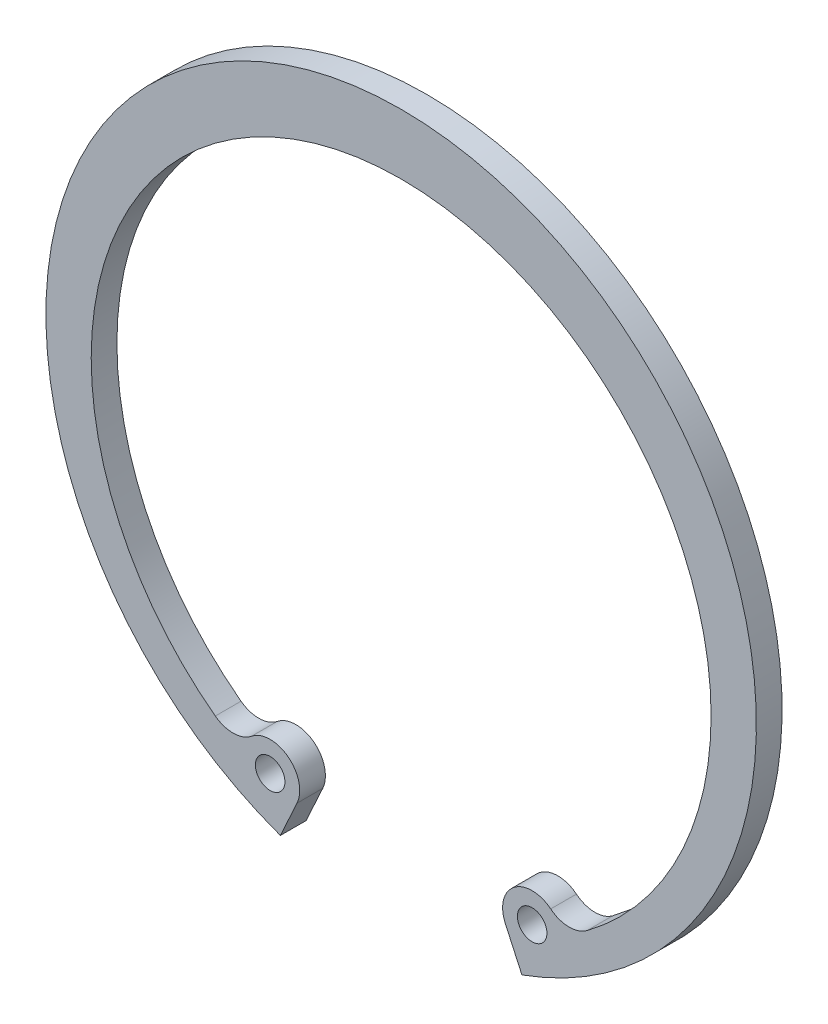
ISO-10303-21;
HEADER;
FILE_DESCRIPTION(('STEP AP214'),'2;1');
FILE_NAME('part.step','',(''),(''),'','','');
FILE_SCHEMA(('AUTOMOTIVE_DESIGN { 1 0 10303 214 1 1 1 1 }'));
ENDSEC;
DATA;
#1=APPLICATION_CONTEXT('core data for automotive mechanical design processes');
#2=APPLICATION_PROTOCOL_DEFINITION('international standard','automotive_design',2000,#1);
#3=PRODUCT_CONTEXT('',#1,'mechanical');
#4=PRODUCT('Part','Part','',(#3));
#5=PRODUCT_RELATED_PRODUCT_CATEGORY('part','',(#4));
#6=PRODUCT_DEFINITION_FORMATION('','',#4);
#7=PRODUCT_DEFINITION_CONTEXT('part definition',#1,'design');
#8=PRODUCT_DEFINITION('design','',#6,#7);
#9=PRODUCT_DEFINITION_SHAPE('','',#8);
#10=(LENGTH_UNIT() NAMED_UNIT(*) SI_UNIT(.MILLI.,.METRE.));
#11=(NAMED_UNIT(*) PLANE_ANGLE_UNIT() SI_UNIT($,.RADIAN.));
#12=(NAMED_UNIT(*) SI_UNIT($,.STERADIAN.) SOLID_ANGLE_UNIT());
#13=UNCERTAINTY_MEASURE_WITH_UNIT(LENGTH_MEASURE(1.E-05),#10,'distance_accuracy_value','');
#14=(GEOMETRIC_REPRESENTATION_CONTEXT(3) GLOBAL_UNCERTAINTY_ASSIGNED_CONTEXT((#13)) GLOBAL_UNIT_ASSIGNED_CONTEXT((#10,
#11,#12)) REPRESENTATION_CONTEXT('',''));
#15=CARTESIAN_POINT('',(0.,0.,0.));
#16=DIRECTION('',(0.,0.,1.));
#17=DIRECTION('',(1.,0.,0.));
#18=AXIS2_PLACEMENT_3D('',#15,#16,#17);
#19=CARTESIAN_POINT('',(-0.05835443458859,-24.7386364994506,0.));
#20=DIRECTION('',(0.,0.,1.));
#21=DIRECTION('',(1.,0.,0.));
#22=AXIS2_PLACEMENT_3D('',#19,#20,#21);
#23=PLANE('',#22);
#24=CARTESIAN_POINT('',(-10.1968416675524,-47.222216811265,0.));
#25=DIRECTION('',(0.,0.,1.));
#26=DIRECTION('',(1.,0.,0.));
#27=AXIS2_PLACEMENT_3D('',#24,#25,#26);
#28=CIRCLE('',#27,1.15);
#29=CARTESIAN_POINT('',(-9.04684166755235,-47.222216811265,0.));
#30=VERTEX_POINT('',#29);
#31=EDGE_CURVE('E130',#30,#30,#28,.T.);
#32=ORIENTED_EDGE('',*,*,#31,.T.);
#33=EDGE_LOOP('',(#32));
#34=FACE_BOUND('',#33,.T.);
#35=CARTESIAN_POINT('',(10.1968416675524,-47.222216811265,0.));
#36=DIRECTION('',(0.,0.,1.));
#37=DIRECTION('',(1.,0.,0.));
#38=AXIS2_PLACEMENT_3D('',#35,#36,#37);
#39=CIRCLE('',#38,1.15);
#40=CARTESIAN_POINT('',(11.3468416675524,-47.222216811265,0.));
#41=VERTEX_POINT('',#40);
#42=EDGE_CURVE('E133',#41,#41,#39,.T.);
#43=ORIENTED_EDGE('',*,*,#42,.T.);
#44=EDGE_LOOP('',(#43));
#45=FACE_BOUND('',#44,.T.);
#46=CARTESIAN_POINT('',(-13.0853713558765,-43.6422173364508,0.));
#47=DIRECTION('',(0.,0.,1.));
#48=DIRECTION('',(1.,0.,0.));
#49=AXIS2_PLACEMENT_3D('',#46,#47,#48);
#50=CIRCLE('',#49,2.3);
#51=CARTESIAN_POINT('',(-14.464356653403,-45.4829779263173,0.));
#52=VERTEX_POINT('',#51);
#53=CARTESIAN_POINT('',(-11.6411065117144,-45.4322170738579,0.));
#54=VERTEX_POINT('',#53);
#55=EDGE_CURVE('E136',#52,#54,#50,.T.);
#56=ORIENTED_EDGE('',*,*,#55,.T.);
#57=CARTESIAN_POINT('',(-10.1968416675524,-47.222216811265,0.));
#58=DIRECTION('',(0.,0.,1.));
#59=DIRECTION('',(1.,0.,0.));
#60=AXIS2_PLACEMENT_3D('',#57,#58,#59);
#61=CIRCLE('',#60,2.3);
#62=CARTESIAN_POINT('',(-8.10640818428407,-48.1814289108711,0.));
#63=VERTEX_POINT('',#62);
#64=EDGE_CURVE('E138',#63,#54,#61,.T.);
#65=ORIENTED_EDGE('',*,*,#64,.F.);
#66=DIRECTION('',(0.417048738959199,0.908884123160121,0.));
#67=VECTOR('',#66,1.);
#68=CARTESIAN_POINT('',(-8.10640818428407,-48.1814289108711,0.));
#69=LINE('',#68,#67);
#70=CARTESIAN_POINT('',(-9.40100000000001,-51.0027632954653,0.));
#71=VERTEX_POINT('',#70);
#72=EDGE_CURVE('E103',#71,#63,#69,.T.);
#73=ORIENTED_EDGE('',*,*,#72,.F.);
#74=CARTESIAN_POINT('',(0.,-25.,0.));
#75=DIRECTION('',(0.,0.,1.));
#76=DIRECTION('',(1.,0.,0.));
#77=AXIS2_PLACEMENT_3D('',#74,#75,#76);
#78=CIRCLE('',#77,27.65);
#79=CARTESIAN_POINT('',(9.40100000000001,-51.0027632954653,0.));
#80=VERTEX_POINT('',#79);
#81=EDGE_CURVE('E140',#80,#71,#78,.T.);
#82=ORIENTED_EDGE('',*,*,#81,.F.);
#83=DIRECTION('',(0.417048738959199,-0.908884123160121,0.));
#84=VECTOR('',#83,1.);
#85=CARTESIAN_POINT('',(9.401,-51.0027632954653,0.));
#86=LINE('',#85,#84);
#87=CARTESIAN_POINT('',(8.10640818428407,-48.1814289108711,0.));
#88=VERTEX_POINT('',#87);
#89=EDGE_CURVE('E107',#88,#80,#86,.T.);
#90=ORIENTED_EDGE('',*,*,#89,.F.);
#91=CARTESIAN_POINT('',(10.1968416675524,-47.222216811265,0.));
#92=DIRECTION('',(0.,0.,1.));
#93=DIRECTION('',(1.,0.,0.));
#94=AXIS2_PLACEMENT_3D('',#91,#92,#93);
#95=CIRCLE('',#94,2.3);
#96=CARTESIAN_POINT('',(11.6411065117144,-45.4322170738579,0.));
#97=VERTEX_POINT('',#96);
#98=EDGE_CURVE('E83',#97,#88,#95,.T.);
#99=ORIENTED_EDGE('',*,*,#98,.F.);
#100=CARTESIAN_POINT('',(13.0853713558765,-43.6422173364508,0.));
#101=DIRECTION('',(0.,0.,1.));
#102=DIRECTION('',(1.,0.,0.));
#103=AXIS2_PLACEMENT_3D('',#100,#101,#102);
#104=CIRCLE('',#103,2.3);
#105=CARTESIAN_POINT('',(14.464356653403,-45.4829779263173,0.));
#106=VERTEX_POINT('',#105);
#107=EDGE_CURVE('E79',#97,#106,#104,.T.);
#108=ORIENTED_EDGE('',*,*,#107,.T.);
#109=CARTESIAN_POINT('',(0.,-26.175,0.));
#110=DIRECTION('',(0.,0.,1.));
#111=DIRECTION('',(1.,0.,0.));
#112=AXIS2_PLACEMENT_3D('',#109,#110,#111);
#113=CIRCLE('',#112,24.125);
#114=EDGE_CURVE('E19',#106,#52,#113,.T.);
#115=ORIENTED_EDGE('',*,*,#114,.T.);
#116=EDGE_LOOP('',(#56,#65,#73,#82,#90,#99,#108,#115));
#117=FACE_BOUND('',#116,.T.);
#118=ADVANCED_FACE('F16',(#34,#45,#117),#23,.F.);
#119=CARTESIAN_POINT('',(0.,-26.175,0.));
#120=DIRECTION('',(0.,0.,1.));
#121=DIRECTION('',(1.,0.,0.));
#122=AXIS2_PLACEMENT_3D('',#119,#120,#121);
#123=CYLINDRICAL_SURFACE('',#122,24.125);
#124=DIRECTION('',(0.,0.,1.));
#125=VECTOR('',#124,1.);
#126=CARTESIAN_POINT('',(-14.464356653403,-45.4829779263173,0.));
#127=LINE('',#126,#125);
#128=CARTESIAN_POINT('',(-14.464356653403,-45.4829779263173,2.));
#129=VERTEX_POINT('',#128);
#130=EDGE_CURVE('E92',#129,#52,#127,.F.);
#131=ORIENTED_EDGE('',*,*,#130,.T.);
#132=ORIENTED_EDGE('',*,*,#114,.F.);
#133=DIRECTION('',(0.,0.,1.));
#134=VECTOR('',#133,1.);
#135=CARTESIAN_POINT('',(14.464356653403,-45.4829779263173,0.));
#136=LINE('',#135,#134);
#137=CARTESIAN_POINT('',(14.464356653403,-45.4829779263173,2.));
#138=VERTEX_POINT('',#137);
#139=EDGE_CURVE('E87',#106,#138,#136,.T.);
#140=ORIENTED_EDGE('',*,*,#139,.T.);
#141=CARTESIAN_POINT('',(0.,-26.175,2.));
#142=DIRECTION('',(0.,0.,1.));
#143=DIRECTION('',(1.,0.,0.));
#144=AXIS2_PLACEMENT_3D('',#141,#142,#143);
#145=CIRCLE('',#144,24.125);
#146=EDGE_CURVE('E128',#129,#138,#145,.F.);
#147=ORIENTED_EDGE('',*,*,#146,.F.);
#148=EDGE_LOOP('',(#131,#132,#140,#147));
#149=FACE_BOUND('',#148,.T.);
#150=ADVANCED_FACE('F89',(#149),#123,.F.);
#151=CARTESIAN_POINT('',(13.0853713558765,-43.6422173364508,0.));
#152=DIRECTION('',(0.,0.,1.));
#153=DIRECTION('',(1.,0.,0.));
#154=AXIS2_PLACEMENT_3D('',#151,#152,#153);
#155=CYLINDRICAL_SURFACE('',#154,2.3);
#156=ORIENTED_EDGE('',*,*,#139,.F.);
#157=ORIENTED_EDGE('',*,*,#107,.F.);
#158=DIRECTION('',(0.,0.,1.));
#159=VECTOR('',#158,1.);
#160=CARTESIAN_POINT('',(11.6411065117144,-45.4322170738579,0.));
#161=LINE('',#160,#159);
#162=CARTESIAN_POINT('',(11.6411065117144,-45.4322170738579,2.));
#163=VERTEX_POINT('',#162);
#164=EDGE_CURVE('E98',#163,#97,#161,.F.);
#165=ORIENTED_EDGE('',*,*,#164,.F.);
#166=CARTESIAN_POINT('',(13.0853713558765,-43.6422173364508,2.));
#167=DIRECTION('',(0.,0.,1.));
#168=DIRECTION('',(1.,0.,0.));
#169=AXIS2_PLACEMENT_3D('',#166,#167,#168);
#170=CIRCLE('',#169,2.3);
#171=EDGE_CURVE('E96',#138,#163,#170,.F.);
#172=ORIENTED_EDGE('',*,*,#171,.F.);
#173=EDGE_LOOP('',(#156,#157,#165,#172));
#174=FACE_BOUND('',#173,.T.);
#175=ADVANCED_FACE('F94',(#174),#155,.F.);
#176=CARTESIAN_POINT('',(10.1968416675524,-47.222216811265,0.));
#177=DIRECTION('',(0.,0.,1.));
#178=DIRECTION('',(1.,0.,0.));
#179=AXIS2_PLACEMENT_3D('',#176,#177,#178);
#180=CYLINDRICAL_SURFACE('',#179,2.3);
#181=ORIENTED_EDGE('',*,*,#98,.T.);
#182=DIRECTION('',(0.,0.,1.));
#183=VECTOR('',#182,1.);
#184=CARTESIAN_POINT('',(8.10640818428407,-48.1814289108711,0.));
#185=LINE('',#184,#183);
#186=CARTESIAN_POINT('',(8.10640818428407,-48.1814289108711,2.));
#187=VERTEX_POINT('',#186);
#188=EDGE_CURVE('E109',#187,#88,#185,.F.);
#189=ORIENTED_EDGE('',*,*,#188,.F.);
#190=CARTESIAN_POINT('',(10.1968416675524,-47.222216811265,2.));
#191=DIRECTION('',(0.,0.,1.));
#192=DIRECTION('',(1.,0.,0.));
#193=AXIS2_PLACEMENT_3D('',#190,#191,#192);
#194=CIRCLE('',#193,2.3);
#195=EDGE_CURVE('E124',#163,#187,#194,.T.);
#196=ORIENTED_EDGE('',*,*,#195,.F.);
#197=ORIENTED_EDGE('',*,*,#164,.T.);
#198=EDGE_LOOP('',(#181,#189,#196,#197));
#199=FACE_BOUND('',#198,.T.);
#200=ADVANCED_FACE('F210',(#199),#180,.T.);
#201=CARTESIAN_POINT('',(9.401,-51.0027632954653,0.));
#202=DIRECTION('',(-0.908884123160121,-0.417048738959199,0.));
#203=DIRECTION('',(0.417048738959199,-0.908884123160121,0.));
#204=AXIS2_PLACEMENT_3D('',#201,#202,#203);
#205=PLANE('',#204);
#206=ORIENTED_EDGE('',*,*,#89,.T.);
#207=DIRECTION('',(0.,0.,1.));
#208=VECTOR('',#207,1.);
#209=CARTESIAN_POINT('',(9.40100000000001,-51.0027632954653,0.));
#210=LINE('',#209,#208);
#211=CARTESIAN_POINT('',(9.40100000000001,-51.0027632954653,2.));
#212=VERTEX_POINT('',#211);
#213=EDGE_CURVE('E108',#212,#80,#210,.F.);
#214=ORIENTED_EDGE('',*,*,#213,.F.);
#215=DIRECTION('',(0.417048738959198,-0.908884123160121,0.));
#216=VECTOR('',#215,1.);
#217=CARTESIAN_POINT('',(8.10640818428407,-48.1814289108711,2.));
#218=LINE('',#217,#216);
#219=EDGE_CURVE('E123',#187,#212,#218,.T.);
#220=ORIENTED_EDGE('',*,*,#219,.F.);
#221=ORIENTED_EDGE('',*,*,#188,.T.);
#222=EDGE_LOOP('',(#206,#214,#220,#221));
#223=FACE_BOUND('',#222,.T.);
#224=ADVANCED_FACE('F215',(#223),#205,.T.);
#225=CARTESIAN_POINT('',(0.,-25.,0.));
#226=DIRECTION('',(0.,0.,1.));
#227=DIRECTION('',(1.,0.,0.));
#228=AXIS2_PLACEMENT_3D('',#225,#226,#227);
#229=CYLINDRICAL_SURFACE('',#228,27.65);
#230=ORIENTED_EDGE('',*,*,#81,.T.);
#231=DIRECTION('',(0.,0.,1.));
#232=VECTOR('',#231,1.);
#233=CARTESIAN_POINT('',(-9.40100000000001,-51.0027632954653,0.));
#234=LINE('',#233,#232);
#235=CARTESIAN_POINT('',(-9.401,-51.0027632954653,2.));
#236=VERTEX_POINT('',#235);
#237=EDGE_CURVE('E106',#236,#71,#234,.F.);
#238=ORIENTED_EDGE('',*,*,#237,.F.);
#239=CARTESIAN_POINT('',(0.,-25.,2.));
#240=DIRECTION('',(0.,0.,1.));
#241=DIRECTION('',(1.,0.,0.));
#242=AXIS2_PLACEMENT_3D('',#239,#240,#241);
#243=CIRCLE('',#242,27.65);
#244=EDGE_CURVE('E120',#212,#236,#243,.T.);
#245=ORIENTED_EDGE('',*,*,#244,.F.);
#246=ORIENTED_EDGE('',*,*,#213,.T.);
#247=EDGE_LOOP('',(#230,#238,#245,#246));
#248=FACE_BOUND('',#247,.T.);
#249=ADVANCED_FACE('F178',(#248),#229,.T.);
#250=CARTESIAN_POINT('',(-8.10640818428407,-48.1814289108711,0.));
#251=DIRECTION('',(0.908884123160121,-0.417048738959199,0.));
#252=DIRECTION('',(0.417048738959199,0.908884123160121,0.));
#253=AXIS2_PLACEMENT_3D('',#250,#251,#252);
#254=PLANE('',#253);
#255=ORIENTED_EDGE('',*,*,#72,.T.);
#256=DIRECTION('',(0.,0.,1.));
#257=VECTOR('',#256,1.);
#258=CARTESIAN_POINT('',(-8.10640818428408,-48.1814289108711,0.));
#259=LINE('',#258,#257);
#260=CARTESIAN_POINT('',(-8.10640818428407,-48.1814289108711,2.));
#261=VERTEX_POINT('',#260);
#262=EDGE_CURVE('E105',#261,#63,#259,.F.);
#263=ORIENTED_EDGE('',*,*,#262,.F.);
#264=DIRECTION('',(0.417048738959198,0.908884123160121,0.));
#265=VECTOR('',#264,1.);
#266=CARTESIAN_POINT('',(-9.401,-51.0027632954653,2.));
#267=LINE('',#266,#265);
#268=EDGE_CURVE('E119',#236,#261,#267,.T.);
#269=ORIENTED_EDGE('',*,*,#268,.F.);
#270=ORIENTED_EDGE('',*,*,#237,.T.);
#271=EDGE_LOOP('',(#255,#263,#269,#270));
#272=FACE_BOUND('',#271,.T.);
#273=ADVANCED_FACE('F163',(#272),#254,.T.);
#274=CARTESIAN_POINT('',(-10.1968416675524,-47.222216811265,0.));
#275=DIRECTION('',(0.,0.,1.));
#276=DIRECTION('',(1.,0.,0.));
#277=AXIS2_PLACEMENT_3D('',#274,#275,#276);
#278=CYLINDRICAL_SURFACE('',#277,2.3);
#279=ORIENTED_EDGE('',*,*,#64,.T.);
#280=DIRECTION('',(0.,0.,1.));
#281=VECTOR('',#280,1.);
#282=CARTESIAN_POINT('',(-11.6411065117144,-45.4322170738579,0.));
#283=LINE('',#282,#281);
#284=CARTESIAN_POINT('',(-11.6411065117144,-45.4322170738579,2.));
#285=VERTEX_POINT('',#284);
#286=EDGE_CURVE('E34',#54,#285,#283,.T.);
#287=ORIENTED_EDGE('',*,*,#286,.T.);
#288=CARTESIAN_POINT('',(-10.1968416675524,-47.222216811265,2.));
#289=DIRECTION('',(0.,0.,1.));
#290=DIRECTION('',(1.,0.,0.));
#291=AXIS2_PLACEMENT_3D('',#288,#289,#290);
#292=CIRCLE('',#291,2.3);
#293=EDGE_CURVE('E116',#261,#285,#292,.T.);
#294=ORIENTED_EDGE('',*,*,#293,.F.);
#295=ORIENTED_EDGE('',*,*,#262,.T.);
#296=EDGE_LOOP('',(#279,#287,#294,#295));
#297=FACE_BOUND('',#296,.T.);
#298=ADVANCED_FACE('F166',(#297),#278,.T.);
#299=CARTESIAN_POINT('',(-13.0853713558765,-43.6422173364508,0.));
#300=DIRECTION('',(0.,0.,1.));
#301=DIRECTION('',(1.,0.,0.));
#302=AXIS2_PLACEMENT_3D('',#299,#300,#301);
#303=CYLINDRICAL_SURFACE('',#302,2.3);
#304=ORIENTED_EDGE('',*,*,#286,.F.);
#305=ORIENTED_EDGE('',*,*,#55,.F.);
#306=ORIENTED_EDGE('',*,*,#130,.F.);
#307=CARTESIAN_POINT('',(-13.0853713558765,-43.6422173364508,2.));
#308=DIRECTION('',(0.,0.,1.));
#309=DIRECTION('',(1.,0.,0.));
#310=AXIS2_PLACEMENT_3D('',#307,#308,#309);
#311=CIRCLE('',#310,2.3);
#312=EDGE_CURVE('E113',#285,#129,#311,.F.);
#313=ORIENTED_EDGE('',*,*,#312,.F.);
#314=EDGE_LOOP('',(#304,#305,#306,#313));
#315=FACE_BOUND('',#314,.T.);
#316=ADVANCED_FACE('F168',(#315),#303,.F.);
#317=CARTESIAN_POINT('',(10.1968416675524,-47.222216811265,0.));
#318=DIRECTION('',(0.,0.,1.));
#319=DIRECTION('',(1.,0.,0.));
#320=AXIS2_PLACEMENT_3D('',#317,#318,#319);
#321=CYLINDRICAL_SURFACE('',#320,1.15);
#322=ORIENTED_EDGE('',*,*,#42,.F.);
#323=EDGE_LOOP('',(#322));
#324=FACE_BOUND('',#323,.T.);
#325=CARTESIAN_POINT('',(10.1968416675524,-47.222216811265,2.));
#326=DIRECTION('',(0.,0.,1.));
#327=DIRECTION('',(1.,0.,0.));
#328=AXIS2_PLACEMENT_3D('',#325,#326,#327);
#329=CIRCLE('',#328,1.15);
#330=CARTESIAN_POINT('',(11.3468416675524,-47.222216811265,2.));
#331=VERTEX_POINT('',#330);
#332=EDGE_CURVE('E25',#331,#331,#329,.F.);
#333=ORIENTED_EDGE('',*,*,#332,.F.);
#334=EDGE_LOOP('',(#333));
#335=FACE_BOUND('',#334,.T.);
#336=ADVANCED_FACE('F175',(#324,#335),#321,.F.);
#337=CARTESIAN_POINT('',(-10.1968416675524,-47.222216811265,0.));
#338=DIRECTION('',(0.,0.,1.));
#339=DIRECTION('',(1.,0.,0.));
#340=AXIS2_PLACEMENT_3D('',#337,#338,#339);
#341=CYLINDRICAL_SURFACE('',#340,1.15);
#342=ORIENTED_EDGE('',*,*,#31,.F.);
#343=EDGE_LOOP('',(#342));
#344=FACE_BOUND('',#343,.T.);
#345=CARTESIAN_POINT('',(-10.1968416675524,-47.222216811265,2.));
#346=DIRECTION('',(0.,0.,1.));
#347=DIRECTION('',(1.,0.,0.));
#348=AXIS2_PLACEMENT_3D('',#345,#346,#347);
#349=CIRCLE('',#348,1.15);
#350=CARTESIAN_POINT('',(-9.04684166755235,-47.222216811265,2.));
#351=VERTEX_POINT('',#350);
#352=EDGE_CURVE('E11',#351,#351,#349,.F.);
#353=ORIENTED_EDGE('',*,*,#352,.F.);
#354=EDGE_LOOP('',(#353));
#355=FACE_BOUND('',#354,.T.);
#356=ADVANCED_FACE('F181',(#344,#355),#341,.F.);
#357=CARTESIAN_POINT('',(-0.058354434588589,-24.7386364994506,2.));
#358=DIRECTION('',(0.,0.,1.));
#359=DIRECTION('',(1.,0.,0.));
#360=AXIS2_PLACEMENT_3D('',#357,#358,#359);
#361=PLANE('',#360);
#362=ORIENTED_EDGE('',*,*,#352,.T.);
#363=EDGE_LOOP('',(#362));
#364=FACE_BOUND('',#363,.T.);
#365=ORIENTED_EDGE('',*,*,#332,.T.);
#366=EDGE_LOOP('',(#365));
#367=FACE_BOUND('',#366,.T.);
#368=ORIENTED_EDGE('',*,*,#293,.T.);
#369=ORIENTED_EDGE('',*,*,#312,.T.);
#370=ORIENTED_EDGE('',*,*,#146,.T.);
#371=ORIENTED_EDGE('',*,*,#171,.T.);
#372=ORIENTED_EDGE('',*,*,#195,.T.);
#373=ORIENTED_EDGE('',*,*,#219,.T.);
#374=ORIENTED_EDGE('',*,*,#244,.T.);
#375=ORIENTED_EDGE('',*,*,#268,.T.);
#376=EDGE_LOOP('',(#368,#369,#370,#371,#372,#373,#374,#375));
#377=FACE_BOUND('',#376,.T.);
#378=ADVANCED_FACE('F160',(#364,#367,#377),#361,.T.);
#379=CLOSED_SHELL('',(#118,#150,#175,#200,#224,#249,#273,#298,#316,#336,#356,#378));
#380=MANIFOLD_SOLID_BREP('B1',#379);
#381=ADVANCED_BREP_SHAPE_REPRESENTATION('',(#18,#380),#14);
#382=SHAPE_DEFINITION_REPRESENTATION(#9,#381);
ENDSEC;
END-ISO-10303-21;
